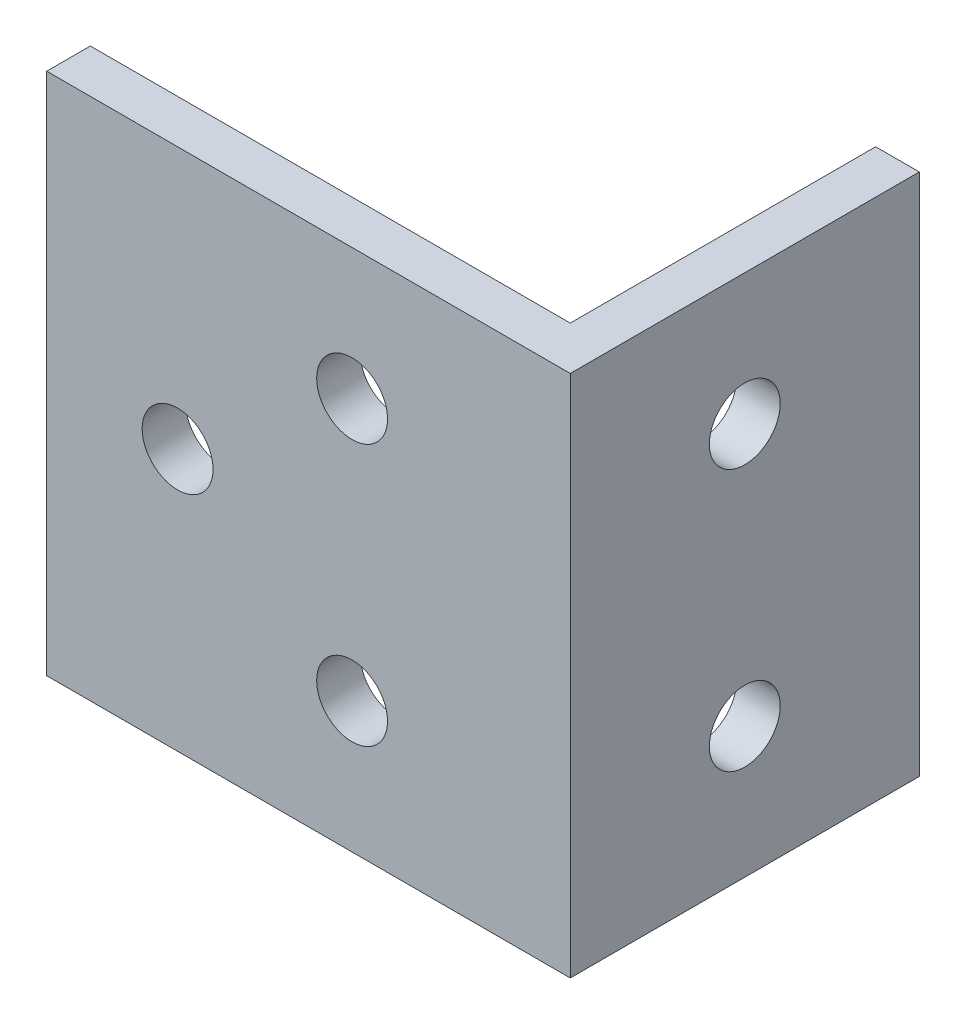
ISO-10303-21;
HEADER;
FILE_DESCRIPTION(('STEP AP214'),'2;1');
FILE_NAME('part.step','',(''),(''),'','','');
FILE_SCHEMA(('AUTOMOTIVE_DESIGN { 1 0 10303 214 1 1 1 1 }'));
ENDSEC;
DATA;
#1=APPLICATION_CONTEXT('core data for automotive mechanical design processes');
#2=APPLICATION_PROTOCOL_DEFINITION('international standard','automotive_design',2000,#1);
#3=PRODUCT_CONTEXT('',#1,'mechanical');
#4=PRODUCT('Part','Part','',(#3));
#5=PRODUCT_RELATED_PRODUCT_CATEGORY('part','',(#4));
#6=PRODUCT_DEFINITION_FORMATION('','',#4);
#7=PRODUCT_DEFINITION_CONTEXT('part definition',#1,'design');
#8=PRODUCT_DEFINITION('design','',#6,#7);
#9=PRODUCT_DEFINITION_SHAPE('','',#8);
#10=(LENGTH_UNIT() NAMED_UNIT(*) SI_UNIT(.MILLI.,.METRE.));
#11=(NAMED_UNIT(*) PLANE_ANGLE_UNIT() SI_UNIT($,.RADIAN.));
#12=(NAMED_UNIT(*) SI_UNIT($,.STERADIAN.) SOLID_ANGLE_UNIT());
#13=UNCERTAINTY_MEASURE_WITH_UNIT(LENGTH_MEASURE(1.E-05),#10,'distance_accuracy_value','');
#14=(GEOMETRIC_REPRESENTATION_CONTEXT(3) GLOBAL_UNCERTAINTY_ASSIGNED_CONTEXT((#13)) GLOBAL_UNIT_ASSIGNED_CONTEXT((#10,
#11,#12)) REPRESENTATION_CONTEXT('',''));
#15=CARTESIAN_POINT('',(0.,0.,0.));
#16=DIRECTION('',(0.,0.,1.));
#17=DIRECTION('',(1.,0.,0.));
#18=AXIS2_PLACEMENT_3D('',#15,#16,#17);
#19=CARTESIAN_POINT('',(0.,0.,12.7));
#20=DIRECTION('',(-1.,0.,0.));
#21=DIRECTION('',(0.,-1.,0.));
#22=AXIS2_PLACEMENT_3D('',#19,#20,#21);
#23=PLANE('',#22);
#24=CARTESIAN_POINT('',(0.,-114.3,-38.1));
#25=DIRECTION('',(1.,0.,0.));
#26=DIRECTION('',(0.,1.,0.));
#27=AXIS2_PLACEMENT_3D('',#24,#25,#26);
#28=CIRCLE('',#27,10.31875);
#29=CARTESIAN_POINT('',(0.,-103.98125,-38.1));
#30=VERTEX_POINT('',#29);
#31=EDGE_CURVE('E202',#30,#30,#28,.T.);
#32=ORIENTED_EDGE('',*,*,#31,.F.);
#33=EDGE_LOOP('',(#32));
#34=FACE_BOUND('',#33,.T.);
#35=CARTESIAN_POINT('',(0.,-38.1,-38.1));
#36=DIRECTION('',(1.,0.,0.));
#37=DIRECTION('',(0.,1.,0.));
#38=AXIS2_PLACEMENT_3D('',#35,#36,#37);
#39=CIRCLE('',#38,10.31875);
#40=CARTESIAN_POINT('',(0.,-27.78125,-38.1));
#41=VERTEX_POINT('',#40);
#42=EDGE_CURVE('E204',#41,#41,#39,.T.);
#43=ORIENTED_EDGE('',*,*,#42,.F.);
#44=EDGE_LOOP('',(#43));
#45=FACE_BOUND('',#44,.T.);
#46=DIRECTION('',(0.,0.,-1.));
#47=VECTOR('',#46,1.);
#48=CARTESIAN_POINT('',(0.,-152.4,12.7));
#49=LINE('',#48,#47);
#50=CARTESIAN_POINT('',(0.,-152.4,12.7));
#51=VERTEX_POINT('',#50);
#52=CARTESIAN_POINT('',(0.,-152.4,-88.9));
#53=VERTEX_POINT('',#52);
#54=EDGE_CURVE('E95',#51,#53,#49,.T.);
#55=ORIENTED_EDGE('',*,*,#54,.T.);
#56=DIRECTION('',(0.,-1.,0.));
#57=VECTOR('',#56,1.);
#58=CARTESIAN_POINT('',(0.,0.,-88.9));
#59=LINE('',#58,#57);
#60=CARTESIAN_POINT('',(0.,0.,-88.9));
#61=VERTEX_POINT('',#60);
#62=EDGE_CURVE('E99',#61,#53,#59,.T.);
#63=ORIENTED_EDGE('',*,*,#62,.F.);
#64=DIRECTION('',(0.,0.,-1.));
#65=VECTOR('',#64,1.);
#66=CARTESIAN_POINT('',(0.,0.,12.7));
#67=LINE('',#66,#65);
#68=CARTESIAN_POINT('',(0.,0.,12.7));
#69=VERTEX_POINT('',#68);
#70=EDGE_CURVE('E11',#69,#61,#67,.T.);
#71=ORIENTED_EDGE('',*,*,#70,.F.);
#72=DIRECTION('',(0.,1.,0.));
#73=VECTOR('',#72,1.);
#74=CARTESIAN_POINT('',(0.,0.,12.7));
#75=LINE('',#74,#73);
#76=EDGE_CURVE('E100',#51,#69,#75,.T.);
#77=ORIENTED_EDGE('',*,*,#76,.F.);
#78=EDGE_LOOP('',(#55,#63,#71,#77));
#79=FACE_BOUND('',#78,.T.);
#80=ADVANCED_FACE('F31',(#34,#45,#79),#23,.F.);
#81=CARTESIAN_POINT('',(0.,0.,12.7));
#82=DIRECTION('',(0.,-1.,0.));
#83=DIRECTION('',(1.,0.,0.));
#84=AXIS2_PLACEMENT_3D('',#81,#82,#83);
#85=PLANE('',#84);
#86=ORIENTED_EDGE('',*,*,#70,.T.);
#87=DIRECTION('',(1.,0.,0.));
#88=VECTOR('',#87,1.);
#89=CARTESIAN_POINT('',(0.,0.,-88.9));
#90=LINE('',#89,#88);
#91=CARTESIAN_POINT('',(-12.7,0.,-88.9));
#92=VERTEX_POINT('',#91);
#93=EDGE_CURVE('E116',#92,#61,#90,.T.);
#94=ORIENTED_EDGE('',*,*,#93,.F.);
#95=DIRECTION('',(0.,0.,1.));
#96=VECTOR('',#95,1.);
#97=CARTESIAN_POINT('',(-12.7,0.,-88.9));
#98=LINE('',#97,#96);
#99=CARTESIAN_POINT('',(-12.7,0.,0.));
#100=VERTEX_POINT('',#99);
#101=EDGE_CURVE('E126',#92,#100,#98,.T.);
#102=ORIENTED_EDGE('',*,*,#101,.T.);
#103=DIRECTION('',(-1.,0.,0.));
#104=VECTOR('',#103,1.);
#105=CARTESIAN_POINT('',(0.,0.,0.));
#106=LINE('',#105,#104);
#107=CARTESIAN_POINT('',(-152.4,0.,0.));
#108=VERTEX_POINT('',#107);
#109=EDGE_CURVE('E132',#100,#108,#106,.T.);
#110=ORIENTED_EDGE('',*,*,#109,.T.);
#111=DIRECTION('',(0.,0.,-1.));
#112=VECTOR('',#111,1.);
#113=CARTESIAN_POINT('',(-152.4,0.,12.7));
#114=LINE('',#113,#112);
#115=CARTESIAN_POINT('',(-152.4,0.,12.7));
#116=VERTEX_POINT('',#115);
#117=EDGE_CURVE('E39',#116,#108,#114,.T.);
#118=ORIENTED_EDGE('',*,*,#117,.F.);
#119=DIRECTION('',(-1.,0.,0.));
#120=VECTOR('',#119,1.);
#121=CARTESIAN_POINT('',(0.,0.,12.7));
#122=LINE('',#121,#120);
#123=EDGE_CURVE('E79',#69,#116,#122,.T.);
#124=ORIENTED_EDGE('',*,*,#123,.F.);
#125=EDGE_LOOP('',(#86,#94,#102,#110,#118,#124));
#126=FACE_BOUND('',#125,.T.);
#127=ADVANCED_FACE('F151',(#126),#85,.F.);
#128=CARTESIAN_POINT('',(-152.4,0.,12.7));
#129=DIRECTION('',(1.,0.,0.));
#130=DIRECTION('',(0.,1.,0.));
#131=AXIS2_PLACEMENT_3D('',#128,#129,#130);
#132=PLANE('',#131);
#133=DIRECTION('',(0.,-1.,0.));
#134=VECTOR('',#133,1.);
#135=CARTESIAN_POINT('',(-152.4,0.,0.));
#136=LINE('',#135,#134);
#137=CARTESIAN_POINT('',(-152.4,-152.4,0.));
#138=VERTEX_POINT('',#137);
#139=EDGE_CURVE('E72',#108,#138,#136,.T.);
#140=ORIENTED_EDGE('',*,*,#139,.T.);
#141=DIRECTION('',(0.,0.,-1.));
#142=VECTOR('',#141,1.);
#143=CARTESIAN_POINT('',(-152.4,-152.4,12.7));
#144=LINE('',#143,#142);
#145=CARTESIAN_POINT('',(-152.4,-152.4,12.7));
#146=VERTEX_POINT('',#145);
#147=EDGE_CURVE('E102',#146,#138,#144,.T.);
#148=ORIENTED_EDGE('',*,*,#147,.F.);
#149=DIRECTION('',(0.,-1.,0.));
#150=VECTOR('',#149,1.);
#151=CARTESIAN_POINT('',(-152.4,0.,12.7));
#152=LINE('',#151,#150);
#153=EDGE_CURVE('E230',#116,#146,#152,.T.);
#154=ORIENTED_EDGE('',*,*,#153,.F.);
#155=ORIENTED_EDGE('',*,*,#117,.T.);
#156=EDGE_LOOP('',(#140,#148,#154,#155));
#157=FACE_BOUND('',#156,.T.);
#158=ADVANCED_FACE('F153',(#157),#132,.F.);
#159=CARTESIAN_POINT('',(0.,-152.4,12.7));
#160=DIRECTION('',(0.,1.,0.));
#161=DIRECTION('',(-1.,0.,0.));
#162=AXIS2_PLACEMENT_3D('',#159,#160,#161);
#163=PLANE('',#162);
#164=DIRECTION('',(1.,0.,0.));
#165=VECTOR('',#164,1.);
#166=CARTESIAN_POINT('',(0.,-152.4,0.));
#167=LINE('',#166,#165);
#168=CARTESIAN_POINT('',(-12.7,-152.4,0.));
#169=VERTEX_POINT('',#168);
#170=EDGE_CURVE('E139',#138,#169,#167,.T.);
#171=ORIENTED_EDGE('',*,*,#170,.T.);
#172=DIRECTION('',(0.,0.,1.));
#173=VECTOR('',#172,1.);
#174=CARTESIAN_POINT('',(-12.7,-152.4,-88.9));
#175=LINE('',#174,#173);
#176=CARTESIAN_POINT('',(-12.7,-152.4,-88.9));
#177=VERTEX_POINT('',#176);
#178=EDGE_CURVE('E108',#177,#169,#175,.T.);
#179=ORIENTED_EDGE('',*,*,#178,.F.);
#180=DIRECTION('',(-1.,0.,0.));
#181=VECTOR('',#180,1.);
#182=CARTESIAN_POINT('',(0.,-152.4,-88.9));
#183=LINE('',#182,#181);
#184=EDGE_CURVE('E105',#53,#177,#183,.T.);
#185=ORIENTED_EDGE('',*,*,#184,.F.);
#186=ORIENTED_EDGE('',*,*,#54,.F.);
#187=DIRECTION('',(1.,0.,0.));
#188=VECTOR('',#187,1.);
#189=CARTESIAN_POINT('',(0.,-152.4,12.7));
#190=LINE('',#189,#188);
#191=EDGE_CURVE('E56',#146,#51,#190,.T.);
#192=ORIENTED_EDGE('',*,*,#191,.F.);
#193=ORIENTED_EDGE('',*,*,#147,.T.);
#194=EDGE_LOOP('',(#171,#179,#185,#186,#192,#193));
#195=FACE_BOUND('',#194,.T.);
#196=ADVANCED_FACE('F106',(#195),#163,.F.);
#197=CARTESIAN_POINT('',(0.,0.,12.7));
#198=DIRECTION('',(0.,0.,-1.));
#199=DIRECTION('',(-1.,0.,0.));
#200=AXIS2_PLACEMENT_3D('',#197,#198,#199);
#201=PLANE('',#200);
#202=CARTESIAN_POINT('',(-114.3,-76.2,12.7));
#203=DIRECTION('',(0.,0.,-1.));
#204=DIRECTION('',(-1.,0.,0.));
#205=AXIS2_PLACEMENT_3D('',#202,#203,#204);
#206=CIRCLE('',#205,10.31875);
#207=CARTESIAN_POINT('',(-124.61875,-76.2,12.7));
#208=VERTEX_POINT('',#207);
#209=EDGE_CURVE('E213',#208,#208,#206,.T.);
#210=ORIENTED_EDGE('',*,*,#209,.T.);
#211=EDGE_LOOP('',(#210));
#212=FACE_BOUND('',#211,.T.);
#213=CARTESIAN_POINT('',(-63.5,-114.3,12.7));
#214=DIRECTION('',(0.,0.,-1.));
#215=DIRECTION('',(-1.,0.,0.));
#216=AXIS2_PLACEMENT_3D('',#213,#214,#215);
#217=CIRCLE('',#216,10.31875);
#218=CARTESIAN_POINT('',(-73.81875,-114.3,12.7));
#219=VERTEX_POINT('',#218);
#220=EDGE_CURVE('E219',#219,#219,#217,.T.);
#221=ORIENTED_EDGE('',*,*,#220,.T.);
#222=EDGE_LOOP('',(#221));
#223=FACE_BOUND('',#222,.T.);
#224=CARTESIAN_POINT('',(-63.5,-38.1,12.7));
#225=DIRECTION('',(0.,0.,-1.));
#226=DIRECTION('',(-1.,0.,0.));
#227=AXIS2_PLACEMENT_3D('',#224,#225,#226);
#228=CIRCLE('',#227,10.31875);
#229=CARTESIAN_POINT('',(-73.81875,-38.1,12.7));
#230=VERTEX_POINT('',#229);
#231=EDGE_CURVE('E118',#230,#230,#228,.T.);
#232=ORIENTED_EDGE('',*,*,#231,.T.);
#233=EDGE_LOOP('',(#232));
#234=FACE_BOUND('',#233,.T.);
#235=ORIENTED_EDGE('',*,*,#76,.T.);
#236=ORIENTED_EDGE('',*,*,#123,.T.);
#237=ORIENTED_EDGE('',*,*,#153,.T.);
#238=ORIENTED_EDGE('',*,*,#191,.T.);
#239=EDGE_LOOP('',(#235,#236,#237,#238));
#240=FACE_BOUND('',#239,.T.);
#241=ADVANCED_FACE('F163',(#212,#223,#234,#240),#201,.F.);
#242=CARTESIAN_POINT('',(0.,0.,0.));
#243=DIRECTION('',(0.,0.,-1.));
#244=DIRECTION('',(-1.,0.,0.));
#245=AXIS2_PLACEMENT_3D('',#242,#243,#244);
#246=PLANE('',#245);
#247=CARTESIAN_POINT('',(-114.3,-76.2,0.));
#248=DIRECTION('',(0.,0.,-1.));
#249=DIRECTION('',(-1.,0.,0.));
#250=AXIS2_PLACEMENT_3D('',#247,#248,#249);
#251=CIRCLE('',#250,10.31875);
#252=CARTESIAN_POINT('',(-124.61875,-76.2,0.));
#253=VERTEX_POINT('',#252);
#254=EDGE_CURVE('E210',#253,#253,#251,.T.);
#255=ORIENTED_EDGE('',*,*,#254,.F.);
#256=EDGE_LOOP('',(#255));
#257=FACE_BOUND('',#256,.T.);
#258=CARTESIAN_POINT('',(-63.5,-114.3,0.));
#259=DIRECTION('',(0.,0.,-1.));
#260=DIRECTION('',(-1.,0.,0.));
#261=AXIS2_PLACEMENT_3D('',#258,#259,#260);
#262=CIRCLE('',#261,10.31875);
#263=CARTESIAN_POINT('',(-73.81875,-114.3,0.));
#264=VERTEX_POINT('',#263);
#265=EDGE_CURVE('E216',#264,#264,#262,.T.);
#266=ORIENTED_EDGE('',*,*,#265,.F.);
#267=EDGE_LOOP('',(#266));
#268=FACE_BOUND('',#267,.T.);
#269=CARTESIAN_POINT('',(-63.5,-38.1,0.));
#270=DIRECTION('',(0.,0.,-1.));
#271=DIRECTION('',(-1.,0.,0.));
#272=AXIS2_PLACEMENT_3D('',#269,#270,#271);
#273=CIRCLE('',#272,10.31875);
#274=CARTESIAN_POINT('',(-73.81875,-38.1,0.));
#275=VERTEX_POINT('',#274);
#276=EDGE_CURVE('E121',#275,#275,#273,.T.);
#277=ORIENTED_EDGE('',*,*,#276,.F.);
#278=EDGE_LOOP('',(#277));
#279=FACE_BOUND('',#278,.T.);
#280=DIRECTION('',(0.,1.,0.));
#281=VECTOR('',#280,1.);
#282=CARTESIAN_POINT('',(-12.7,0.,0.));
#283=LINE('',#282,#281);
#284=EDGE_CURVE('E47',#169,#100,#283,.T.);
#285=ORIENTED_EDGE('',*,*,#284,.F.);
#286=ORIENTED_EDGE('',*,*,#170,.F.);
#287=ORIENTED_EDGE('',*,*,#139,.F.);
#288=ORIENTED_EDGE('',*,*,#109,.F.);
#289=EDGE_LOOP('',(#285,#286,#287,#288));
#290=FACE_BOUND('',#289,.T.);
#291=ADVANCED_FACE('F148',(#257,#268,#279,#290),#246,.T.);
#292=CARTESIAN_POINT('',(-12.7,0.,-88.9));
#293=DIRECTION('',(1.,0.,0.));
#294=DIRECTION('',(0.,1.,0.));
#295=AXIS2_PLACEMENT_3D('',#292,#293,#294);
#296=PLANE('',#295);
#297=CARTESIAN_POINT('',(-12.7,-114.3,-38.1));
#298=DIRECTION('',(1.,0.,0.));
#299=DIRECTION('',(0.,1.,0.));
#300=AXIS2_PLACEMENT_3D('',#297,#298,#299);
#301=CIRCLE('',#300,10.31875);
#302=CARTESIAN_POINT('',(-12.7,-103.98125,-38.1));
#303=VERTEX_POINT('',#302);
#304=EDGE_CURVE('E199',#303,#303,#301,.T.);
#305=ORIENTED_EDGE('',*,*,#304,.T.);
#306=EDGE_LOOP('',(#305));
#307=FACE_BOUND('',#306,.T.);
#308=CARTESIAN_POINT('',(-12.7,-38.1,-38.1));
#309=DIRECTION('',(1.,0.,0.));
#310=DIRECTION('',(0.,1.,0.));
#311=AXIS2_PLACEMENT_3D('',#308,#309,#310);
#312=CIRCLE('',#311,10.31875);
#313=CARTESIAN_POINT('',(-12.7,-27.78125,-38.1));
#314=VERTEX_POINT('',#313);
#315=EDGE_CURVE('E207',#314,#314,#312,.T.);
#316=ORIENTED_EDGE('',*,*,#315,.T.);
#317=EDGE_LOOP('',(#316));
#318=FACE_BOUND('',#317,.T.);
#319=ORIENTED_EDGE('',*,*,#284,.T.);
#320=ORIENTED_EDGE('',*,*,#101,.F.);
#321=DIRECTION('',(0.,1.,0.));
#322=VECTOR('',#321,1.);
#323=CARTESIAN_POINT('',(-12.7,0.,-88.9));
#324=LINE('',#323,#322);
#325=EDGE_CURVE('E111',#177,#92,#324,.T.);
#326=ORIENTED_EDGE('',*,*,#325,.F.);
#327=ORIENTED_EDGE('',*,*,#178,.T.);
#328=EDGE_LOOP('',(#319,#320,#326,#327));
#329=FACE_BOUND('',#328,.T.);
#330=ADVANCED_FACE('F150',(#307,#318,#329),#296,.F.);
#331=CARTESIAN_POINT('',(0.,-152.4,-88.9));
#332=DIRECTION('',(0.,0.,-1.));
#333=DIRECTION('',(-1.,0.,0.));
#334=AXIS2_PLACEMENT_3D('',#331,#332,#333);
#335=PLANE('',#334);
#336=ORIENTED_EDGE('',*,*,#62,.T.);
#337=ORIENTED_EDGE('',*,*,#184,.T.);
#338=ORIENTED_EDGE('',*,*,#325,.T.);
#339=ORIENTED_EDGE('',*,*,#93,.T.);
#340=EDGE_LOOP('',(#336,#337,#338,#339));
#341=FACE_BOUND('',#340,.T.);
#342=ADVANCED_FACE('F114',(#341),#335,.T.);
#343=CARTESIAN_POINT('',(-63.5,-38.1,12.7));
#344=DIRECTION('',(0.,0.,-1.));
#345=DIRECTION('',(-1.,0.,0.));
#346=AXIS2_PLACEMENT_3D('',#343,#344,#345);
#347=CYLINDRICAL_SURFACE('',#346,10.31875);
#348=ORIENTED_EDGE('',*,*,#231,.F.);
#349=EDGE_LOOP('',(#348));
#350=FACE_BOUND('',#349,.T.);
#351=ORIENTED_EDGE('',*,*,#276,.T.);
#352=EDGE_LOOP('',(#351));
#353=FACE_BOUND('',#352,.T.);
#354=ADVANCED_FACE('F175',(#350,#353),#347,.F.);
#355=CARTESIAN_POINT('',(-63.5,-114.3,12.7));
#356=DIRECTION('',(0.,0.,-1.));
#357=DIRECTION('',(-1.,0.,0.));
#358=AXIS2_PLACEMENT_3D('',#355,#356,#357);
#359=CYLINDRICAL_SURFACE('',#358,10.31875);
#360=ORIENTED_EDGE('',*,*,#220,.F.);
#361=EDGE_LOOP('',(#360));
#362=FACE_BOUND('',#361,.T.);
#363=ORIENTED_EDGE('',*,*,#265,.T.);
#364=EDGE_LOOP('',(#363));
#365=FACE_BOUND('',#364,.T.);
#366=ADVANCED_FACE('F178',(#362,#365),#359,.F.);
#367=CARTESIAN_POINT('',(-114.3,-76.2,12.7));
#368=DIRECTION('',(0.,0.,-1.));
#369=DIRECTION('',(-1.,0.,0.));
#370=AXIS2_PLACEMENT_3D('',#367,#368,#369);
#371=CYLINDRICAL_SURFACE('',#370,10.31875);
#372=ORIENTED_EDGE('',*,*,#209,.F.);
#373=EDGE_LOOP('',(#372));
#374=FACE_BOUND('',#373,.T.);
#375=ORIENTED_EDGE('',*,*,#254,.T.);
#376=EDGE_LOOP('',(#375));
#377=FACE_BOUND('',#376,.T.);
#378=ADVANCED_FACE('F182',(#374,#377),#371,.F.);
#379=CARTESIAN_POINT('',(-12.7,-38.1,-38.1));
#380=DIRECTION('',(1.,0.,0.));
#381=DIRECTION('',(0.,1.,0.));
#382=AXIS2_PLACEMENT_3D('',#379,#380,#381);
#383=CYLINDRICAL_SURFACE('',#382,10.31875);
#384=ORIENTED_EDGE('',*,*,#315,.F.);
#385=EDGE_LOOP('',(#384));
#386=FACE_BOUND('',#385,.T.);
#387=ORIENTED_EDGE('',*,*,#42,.T.);
#388=EDGE_LOOP('',(#387));
#389=FACE_BOUND('',#388,.T.);
#390=ADVANCED_FACE('F186',(#386,#389),#383,.F.);
#391=CARTESIAN_POINT('',(-12.7,-114.3,-38.1));
#392=DIRECTION('',(1.,0.,0.));
#393=DIRECTION('',(0.,1.,0.));
#394=AXIS2_PLACEMENT_3D('',#391,#392,#393);
#395=CYLINDRICAL_SURFACE('',#394,10.31875);
#396=ORIENTED_EDGE('',*,*,#304,.F.);
#397=EDGE_LOOP('',(#396));
#398=FACE_BOUND('',#397,.T.);
#399=ORIENTED_EDGE('',*,*,#31,.T.);
#400=EDGE_LOOP('',(#399));
#401=FACE_BOUND('',#400,.T.);
#402=ADVANCED_FACE('F190',(#398,#401),#395,.F.);
#403=CLOSED_SHELL('',(#80,#127,#158,#196,#241,#291,#330,#342,#354,#366,#378,#390,#402));
#404=MANIFOLD_SOLID_BREP('B2',#403);
#405=ADVANCED_BREP_SHAPE_REPRESENTATION('',(#18,#404),#14);
#406=SHAPE_DEFINITION_REPRESENTATION(#9,#405);
ENDSEC;
END-ISO-10303-21;
